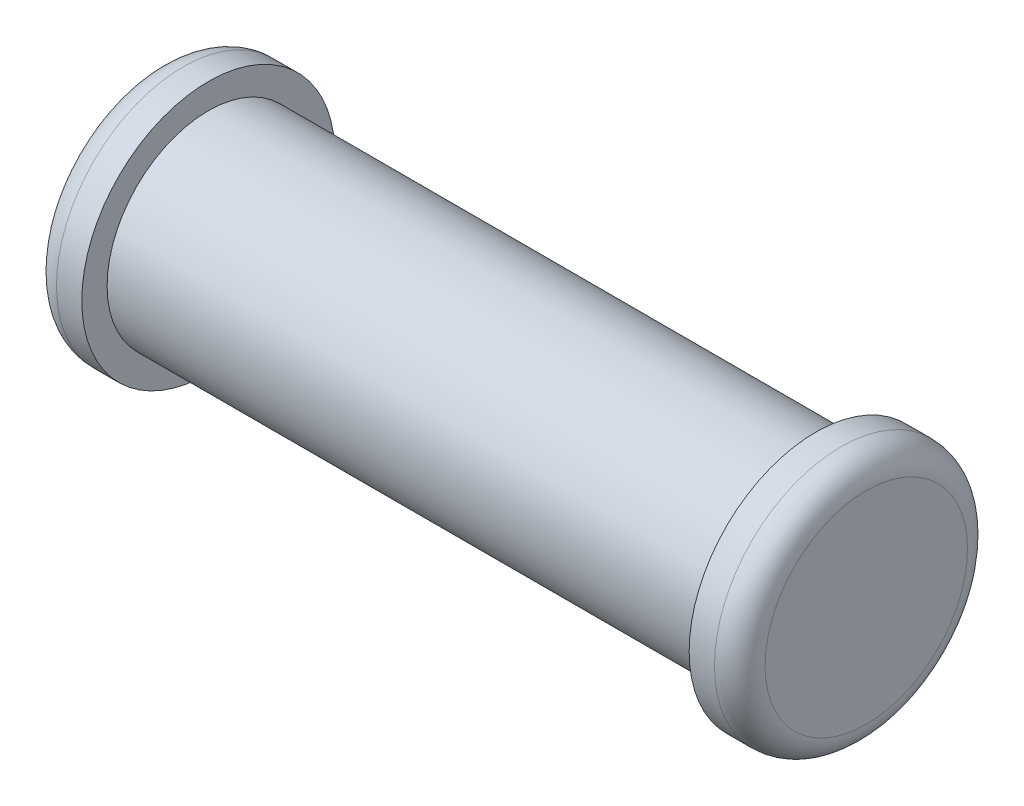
ISO-10303-21;
HEADER;
FILE_DESCRIPTION(('STEP AP214'),'2;1');
FILE_NAME('part.step','',(''),(''),'','','');
FILE_SCHEMA(('AUTOMOTIVE_DESIGN { 1 0 10303 214 1 1 1 1 }'));
ENDSEC;
DATA;
#1=APPLICATION_CONTEXT('core data for automotive mechanical design processes');
#2=APPLICATION_PROTOCOL_DEFINITION('international standard','automotive_design',2000,#1);
#3=PRODUCT_CONTEXT('',#1,'mechanical');
#4=PRODUCT('Part','Part','',(#3));
#5=PRODUCT_RELATED_PRODUCT_CATEGORY('part','',(#4));
#6=PRODUCT_DEFINITION_FORMATION('','',#4);
#7=PRODUCT_DEFINITION_CONTEXT('part definition',#1,'design');
#8=PRODUCT_DEFINITION('design','',#6,#7);
#9=PRODUCT_DEFINITION_SHAPE('','',#8);
#10=(LENGTH_UNIT() NAMED_UNIT(*) SI_UNIT(.MILLI.,.METRE.));
#11=(NAMED_UNIT(*) PLANE_ANGLE_UNIT() SI_UNIT($,.RADIAN.));
#12=(NAMED_UNIT(*) SI_UNIT($,.STERADIAN.) SOLID_ANGLE_UNIT());
#13=UNCERTAINTY_MEASURE_WITH_UNIT(LENGTH_MEASURE(1.E-05),#10,'distance_accuracy_value','');
#14=(GEOMETRIC_REPRESENTATION_CONTEXT(3) GLOBAL_UNCERTAINTY_ASSIGNED_CONTEXT((#13)) GLOBAL_UNIT_ASSIGNED_CONTEXT((#10,
#11,#12)) REPRESENTATION_CONTEXT('',''));
#15=CARTESIAN_POINT('',(0.,0.,0.));
#16=DIRECTION('',(0.,0.,1.));
#17=DIRECTION('',(1.,0.,0.));
#18=AXIS2_PLACEMENT_3D('',#15,#16,#17);
#19=CARTESIAN_POINT('',(12.,0.,0.));
#20=DIRECTION('',(-1.,0.,0.));
#21=DIRECTION('',(0.,0.,1.));
#22=AXIS2_PLACEMENT_3D('',#19,#20,#21);
#23=CYLINDRICAL_SURFACE('',#22,2.);
#24=CARTESIAN_POINT('',(12.,0.,0.));
#25=DIRECTION('',(1.,0.,0.));
#26=DIRECTION('',(0.,0.,-1.));
#27=AXIS2_PLACEMENT_3D('',#24,#25,#26);
#28=CIRCLE('',#27,2.);
#29=CARTESIAN_POINT('',(12.,0.,-2.));
#30=VERTEX_POINT('',#29);
#31=EDGE_CURVE('E63',#30,#30,#28,.T.);
#32=ORIENTED_EDGE('',*,*,#31,.F.);
#33=EDGE_LOOP('',(#32));
#34=FACE_BOUND('',#33,.T.);
#35=CARTESIAN_POINT('',(0.,0.,0.));
#36=DIRECTION('',(1.,0.,0.));
#37=DIRECTION('',(0.,0.,-1.));
#38=AXIS2_PLACEMENT_3D('',#35,#36,#37);
#39=CIRCLE('',#38,2.);
#40=CARTESIAN_POINT('',(0.,0.,-2.));
#41=VERTEX_POINT('',#40);
#42=EDGE_CURVE('E64',#41,#41,#39,.T.);
#43=ORIENTED_EDGE('',*,*,#42,.T.);
#44=EDGE_LOOP('',(#43));
#45=FACE_BOUND('',#44,.T.);
#46=ADVANCED_FACE('F43',(#34,#45),#23,.T.);
#47=CARTESIAN_POINT('',(-1.,0.,0.));
#48=DIRECTION('',(1.,0.,0.));
#49=DIRECTION('',(0.,0.,-1.));
#50=AXIS2_PLACEMENT_3D('',#47,#48,#49);
#51=CYLINDRICAL_SURFACE('',#50,2.5);
#52=CARTESIAN_POINT('',(-0.5,0.,0.));
#53=DIRECTION('',(-1.,0.,0.));
#54=DIRECTION('',(0.,0.,1.));
#55=AXIS2_PLACEMENT_3D('',#52,#53,#54);
#56=CIRCLE('',#55,2.5);
#57=CARTESIAN_POINT('',(-0.5,0.,2.5));
#58=VERTEX_POINT('',#57);
#59=EDGE_CURVE('E54',#58,#58,#56,.F.);
#60=ORIENTED_EDGE('',*,*,#59,.T.);
#61=EDGE_LOOP('',(#60));
#62=FACE_BOUND('',#61,.T.);
#63=CARTESIAN_POINT('',(0.,0.,0.));
#64=DIRECTION('',(-1.,0.,0.));
#65=DIRECTION('',(0.,0.,1.));
#66=AXIS2_PLACEMENT_3D('',#63,#64,#65);
#67=CIRCLE('',#66,2.5);
#68=CARTESIAN_POINT('',(0.,0.,2.5));
#69=VERTEX_POINT('',#68);
#70=EDGE_CURVE('E67',#69,#69,#67,.T.);
#71=ORIENTED_EDGE('',*,*,#70,.T.);
#72=EDGE_LOOP('',(#71));
#73=FACE_BOUND('',#72,.T.);
#74=ADVANCED_FACE('F93',(#62,#73),#51,.T.);
#75=CARTESIAN_POINT('',(-1.,0.,0.));
#76=DIRECTION('',(-1.,0.,0.));
#77=DIRECTION('',(0.,0.,1.));
#78=AXIS2_PLACEMENT_3D('',#75,#76,#77);
#79=PLANE('',#78);
#80=CARTESIAN_POINT('',(-1.,0.,0.));
#81=DIRECTION('',(-1.,0.,0.));
#82=DIRECTION('',(0.,0.,1.));
#83=AXIS2_PLACEMENT_3D('',#80,#81,#82);
#84=CIRCLE('',#83,2.);
#85=CARTESIAN_POINT('',(-1.,0.,2.));
#86=VERTEX_POINT('',#85);
#87=EDGE_CURVE('E58',#86,#86,#84,.T.);
#88=ORIENTED_EDGE('',*,*,#87,.T.);
#89=EDGE_LOOP('',(#88));
#90=FACE_BOUND('',#89,.T.);
#91=ADVANCED_FACE('F100',(#90),#79,.T.);
#92=CARTESIAN_POINT('',(0.,0.,0.));
#93=DIRECTION('',(-1.,0.,0.));
#94=DIRECTION('',(0.,0.,1.));
#95=AXIS2_PLACEMENT_3D('',#92,#93,#94);
#96=PLANE('',#95);
#97=ORIENTED_EDGE('',*,*,#42,.F.);
#98=EDGE_LOOP('',(#97));
#99=FACE_BOUND('',#98,.T.);
#100=ORIENTED_EDGE('',*,*,#70,.F.);
#101=EDGE_LOOP('',(#100));
#102=FACE_BOUND('',#101,.T.);
#103=ADVANCED_FACE('F88',(#99,#102),#96,.F.);
#104=CARTESIAN_POINT('',(-0.5,0.,0.));
#105=DIRECTION('',(-1.,0.,0.));
#106=DIRECTION('',(0.,0.,1.));
#107=AXIS2_PLACEMENT_3D('',#104,#105,#106);
#108=TOROIDAL_SURFACE('',#107,2.,0.5);
#109=ORIENTED_EDGE('',*,*,#59,.F.);
#110=EDGE_LOOP('',(#109));
#111=FACE_BOUND('',#110,.T.);
#112=ORIENTED_EDGE('',*,*,#87,.F.);
#113=EDGE_LOOP('',(#112));
#114=FACE_BOUND('',#113,.T.);
#115=ADVANCED_FACE('F81',(#111,#114),#108,.T.);
#116=CARTESIAN_POINT('',(13.,0.,0.));
#117=DIRECTION('',(-1.,0.,0.));
#118=DIRECTION('',(0.,0.,1.));
#119=AXIS2_PLACEMENT_3D('',#116,#117,#118);
#120=CYLINDRICAL_SURFACE('',#119,2.5);
#121=CARTESIAN_POINT('',(12.5,0.,0.));
#122=DIRECTION('',(1.,0.,0.));
#123=DIRECTION('',(0.,0.,-1.));
#124=AXIS2_PLACEMENT_3D('',#121,#122,#123);
#125=CIRCLE('',#124,2.5);
#126=CARTESIAN_POINT('',(12.5,0.,-2.5));
#127=VERTEX_POINT('',#126);
#128=EDGE_CURVE('E50',#127,#127,#125,.F.);
#129=ORIENTED_EDGE('',*,*,#128,.T.);
#130=EDGE_LOOP('',(#129));
#131=FACE_BOUND('',#130,.T.);
#132=CARTESIAN_POINT('',(12.,0.,0.));
#133=DIRECTION('',(-1.,0.,0.));
#134=DIRECTION('',(0.,0.,1.));
#135=AXIS2_PLACEMENT_3D('',#132,#133,#134);
#136=CIRCLE('',#135,2.5);
#137=CARTESIAN_POINT('',(12.,0.,2.5));
#138=VERTEX_POINT('',#137);
#139=EDGE_CURVE('E72',#138,#138,#136,.T.);
#140=ORIENTED_EDGE('',*,*,#139,.F.);
#141=EDGE_LOOP('',(#140));
#142=FACE_BOUND('',#141,.T.);
#143=ADVANCED_FACE('F78',(#131,#142),#120,.T.);
#144=CARTESIAN_POINT('',(13.,0.,0.));
#145=DIRECTION('',(1.,0.,0.));
#146=DIRECTION('',(0.,0.,1.));
#147=AXIS2_PLACEMENT_3D('',#144,#145,#146);
#148=PLANE('',#147);
#149=CARTESIAN_POINT('',(13.,0.,0.));
#150=DIRECTION('',(1.,0.,0.));
#151=DIRECTION('',(0.,0.,-1.));
#152=AXIS2_PLACEMENT_3D('',#149,#150,#151);
#153=CIRCLE('',#152,2.);
#154=CARTESIAN_POINT('',(13.,0.,-2.));
#155=VERTEX_POINT('',#154);
#156=EDGE_CURVE('E10',#155,#155,#153,.T.);
#157=ORIENTED_EDGE('',*,*,#156,.T.);
#158=EDGE_LOOP('',(#157));
#159=FACE_BOUND('',#158,.T.);
#160=ADVANCED_FACE('F80',(#159),#148,.T.);
#161=CARTESIAN_POINT('',(12.,0.,0.));
#162=DIRECTION('',(1.,0.,0.));
#163=DIRECTION('',(0.,0.,1.));
#164=AXIS2_PLACEMENT_3D('',#161,#162,#163);
#165=PLANE('',#164);
#166=ORIENTED_EDGE('',*,*,#31,.T.);
#167=EDGE_LOOP('',(#166));
#168=FACE_BOUND('',#167,.T.);
#169=ORIENTED_EDGE('',*,*,#139,.T.);
#170=EDGE_LOOP('',(#169));
#171=FACE_BOUND('',#170,.T.);
#172=ADVANCED_FACE('F76',(#168,#171),#165,.F.);
#173=CARTESIAN_POINT('',(12.5,0.,0.));
#174=DIRECTION('',(1.,0.,0.));
#175=DIRECTION('',(0.,0.,-1.));
#176=AXIS2_PLACEMENT_3D('',#173,#174,#175);
#177=TOROIDAL_SURFACE('',#176,2.,0.5);
#178=ORIENTED_EDGE('',*,*,#156,.F.);
#179=EDGE_LOOP('',(#178));
#180=FACE_BOUND('',#179,.T.);
#181=ORIENTED_EDGE('',*,*,#128,.F.);
#182=EDGE_LOOP('',(#181));
#183=FACE_BOUND('',#182,.T.);
#184=ADVANCED_FACE('F45',(#180,#183),#177,.T.);
#185=CLOSED_SHELL('',(#46,#74,#91,#103,#115,#143,#160,#172,#184));
#186=MANIFOLD_SOLID_BREP('B2',#185);
#187=ADVANCED_BREP_SHAPE_REPRESENTATION('',(#18,#186),#14);
#188=SHAPE_DEFINITION_REPRESENTATION(#9,#187);
ENDSEC;
END-ISO-10303-21;
